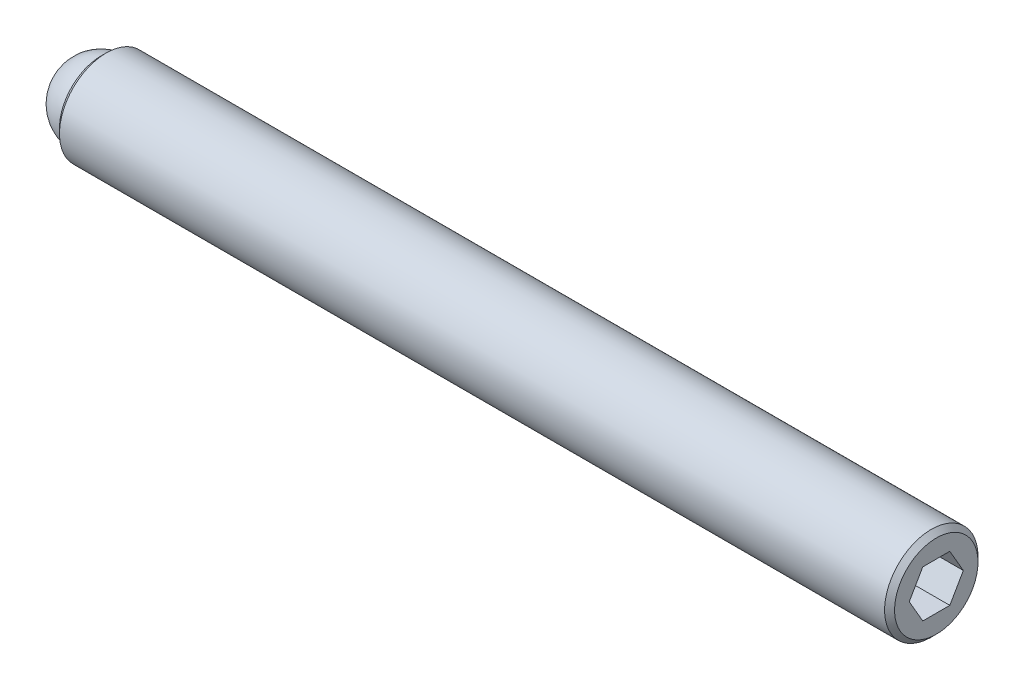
from build123d import *

# Parameters (mm, degrees)
SKETCH2_R           = 2.3749
BOSS_EXTRUDE1_DEPTH = 42.465625
CHAMFER1_SIZE       = 0.254
CHAMFER2_SIZE       = 0.254
CUT_EXTRUDE2_DEPTH  = 2.286
SKETCH3_R           = 1.9812
CUT_EXTRUDE3_DEPTH  = 1.984375


with BuildPart() as part:
    # Sketch2 → Boss-Extrude1 (new body)
    with BuildSketch(Plane(origin=(0, 0, 0), x_dir=(0, 0, -1), z_dir=(1, 0, 0))):
        Circle(SKETCH2_R)
    extrude(amount=BOSS_EXTRUDE1_DEPTH)

    # Chamfer1
    chamfer1_edges = [part.edges().sort_by_distance(p)[0] for p in [
        (0, 0, 2.3749),
    ]]
    chamfer(chamfer1_edges, length=CHAMFER1_SIZE)

    # Chamfer2
    chamfer2_edges = [part.edges().sort_by_distance(p)[0] for p in [
        (42.465625, 0, 2.3749),
    ]]
    chamfer(chamfer2_edges, length=CHAMFER2_SIZE)

    # Sketch4 → Cut-Extrude2 (cut)
    with BuildSketch(Plane(origin=(42.465625, 0, 0), x_dir=(0, 0, -1), z_dir=(1, 0, 0))):
        Polygon((1.374815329, 0), (0.687407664, 1.190625), (-0.687407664, 1.190625), (-1.374815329, 0), (-0.687407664, -1.190625), (0.687407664, -1.190625), align=None)
    extrude(amount=-CUT_EXTRUDE2_DEPTH, mode=Mode.SUBTRACT)

    # Sketch3 → Cut-Extrude3 (cut)
    with BuildSketch(Plane.ZY):
        Circle(SKETCH3_R)
    extrude(amount=-CUT_EXTRUDE3_DEPTH, mode=Mode.SUBTRACT)


with BuildPart() as body_2:
    # Sketch5 → Revolve1 (revolve)
    with BuildSketch(Plane.ZY):
        with BuildLine():
            Line((0, 0), (0, -1.984375))
            ThreePointArc((0, -1.984375), (-1.984375, 0), (0, 1.984375))
            Line((0, 1.984375), (0, 0))
        make_face()
    revolve(axis=Axis((0, 0, 0), (0, 1, 0)))


solid = Compound([part.part, body_2.part])
